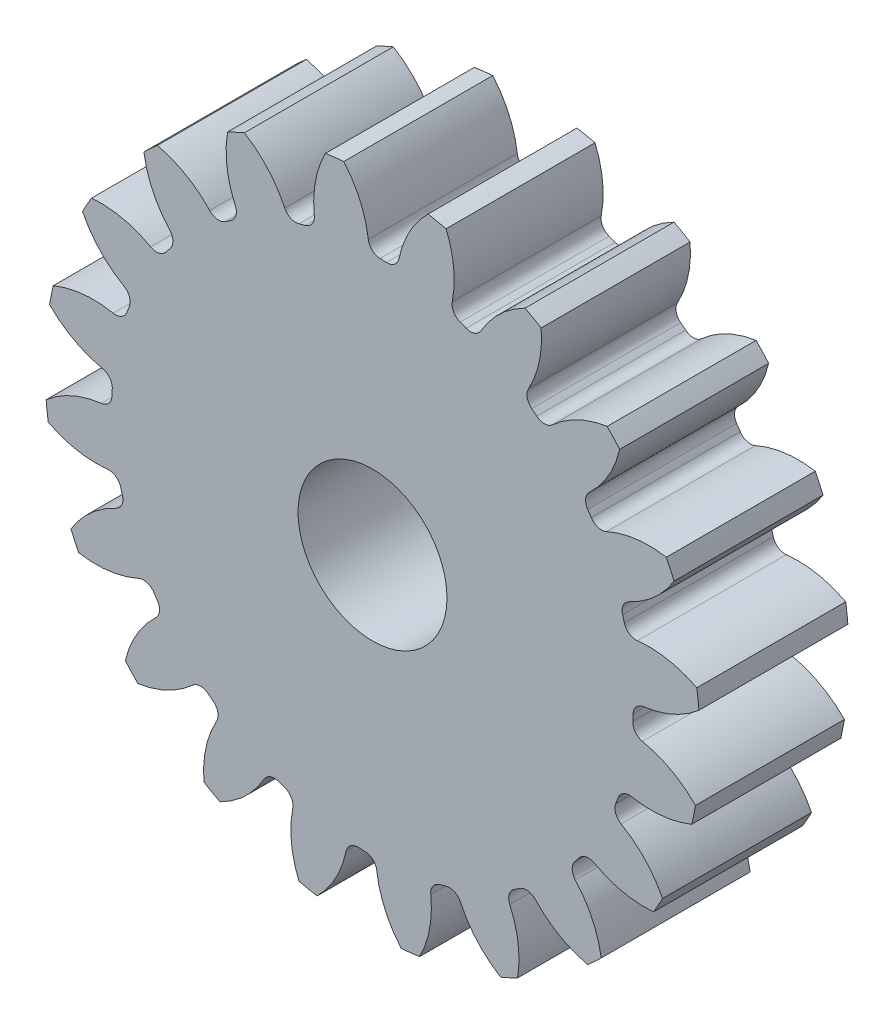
from build123d import *

# Parameters (mm, degrees)
SKETCH3_R         = 223.52
GEARBODY_DEPTH    = 101.6
TOOTHCUT_DEPTH    = 333.031535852
CIRPATTERN1_COUNT = 20
BOREDIA_R         = 50.8
BORE_DEPTH        = 12700


with BuildPart() as part:
    # Sketch3 → gearBody (new body)
    with BuildSketch(Plane.XY):
        Circle(SKETCH3_R)
    extrude(amount=GEARBODY_DEPTH)

    # Sketch2 → toothCut (cut, through all)
    with BuildSketch(Plane.XY):
        with BuildLine():
            ThreePointArc((177.545351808, -9.512520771), (177.650042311, -7.300853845), (177.727183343, -5.088054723))
            ThreePointArc((177.727183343, -5.088054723), (179.880532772, 0.245012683), (184.990533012, 2.884410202))
            ThreePointArc((184.990533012, 2.884410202), (205.591146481, 8.663861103), (223.52, 20.340484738))
            ThreePointArc((223.52, 20.340484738), (224.254294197, -9.216140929), (221.097205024, -38.61284307))
            ThreePointArc((221.097205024, -38.61284307), (204.18693749, -25.504441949), (184.130026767, -18.05409563))
            ThreePointArc((184.130026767, -18.05409563), (179.253834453, -15.004297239), (177.545351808, -9.512520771))
        make_face()
    toothcut = extrude(amount=TOOTHCUT_DEPTH, mode=Mode.SUBTRACT)

    # CirPattern1: toothCut ×20 about axis
    cirpattern1_axis = Axis((0, 0, 0), (0, 0, 1))
    for i in range(1, CIRPATTERN1_COUNT):
        add(toothcut.rotate(cirpattern1_axis, i * 360 / CIRPATTERN1_COUNT), mode=Mode.SUBTRACT)

    # boreDia → bore (cut, symmetric)
    with BuildSketch(Plane.XY):
        Circle(BOREDIA_R)
    extrude(amount=BORE_DEPTH, both=True, mode=Mode.SUBTRACT)


solid = part.part
